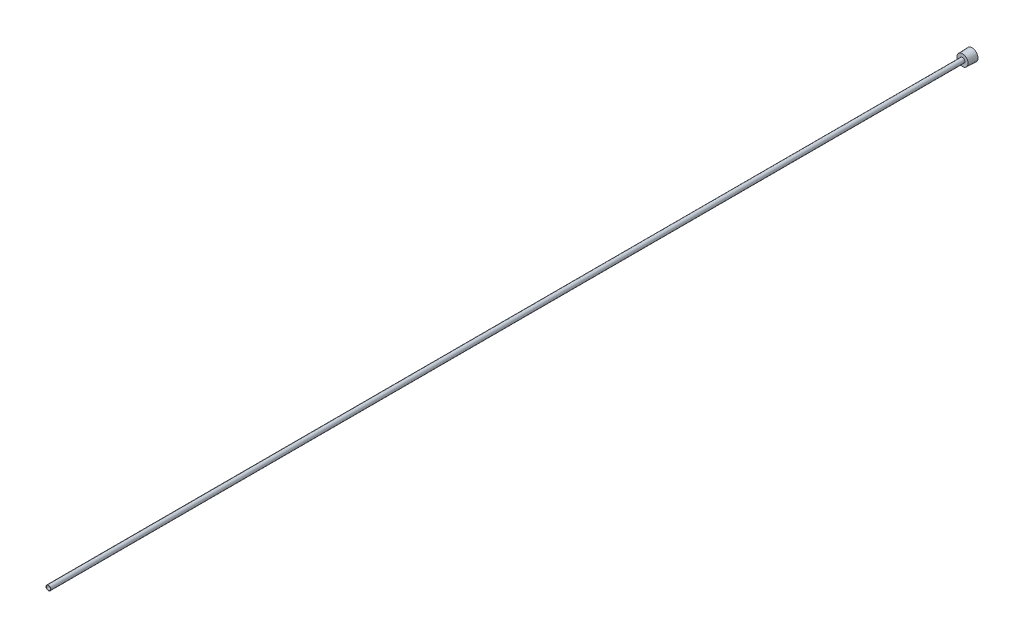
from build123d import *

# Parameters (mm, degrees)
SKETCH2_R          = 1.3843
CUT_EXTRUDE1_DEPTH = 610.624936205
CUT_EXTRUDE2_DEPTH = 2.54


with BuildPart() as part:
    # Sketch1 → Revolve1 (revolve)
    with BuildSketch(Plane(origin=(0, 0, 0), x_dir=(0, 0, -1), z_dir=(1, 0, 0)), mode=Mode.PRIVATE) as revolve1_sk:
        Polygon((-609.6, 0), (0, 0), (0, 3.8989), (-6.35, 3.667387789), (-6.35, 1.5875), (-609.6, 1.5875), align=None)
    revolve(revolve1_sk.sketch.rotate(Axis((0, 0, 0), (0, 0, -1)), 90), axis=Axis((0, 0, 0), (0, 0, -1)))

    # Sketch2 → Cut-Extrude1 (cut, through all)
    with BuildSketch(Plane.XY.offset(609.6)):
        Circle(SKETCH2_R)
    extrude(amount=-CUT_EXTRUDE1_DEPTH, mode=Mode.SUBTRACT)

    # Sketch3 → Cut-Extrude2 (cut)
    with BuildSketch(Plane(origin=(0, 0, 0), x_dir=(-1, 0, 0), z_dir=(0, 0, -1))):
        Polygon((1.374815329, 2.38125), (-1.374815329, 2.38125), (-2.749630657, 0), (-1.374815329, -2.38125), (1.374815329, -2.38125), (2.749630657, 0), align=None)
    extrude(amount=-CUT_EXTRUDE2_DEPTH, mode=Mode.SUBTRACT)


solid = part.part
